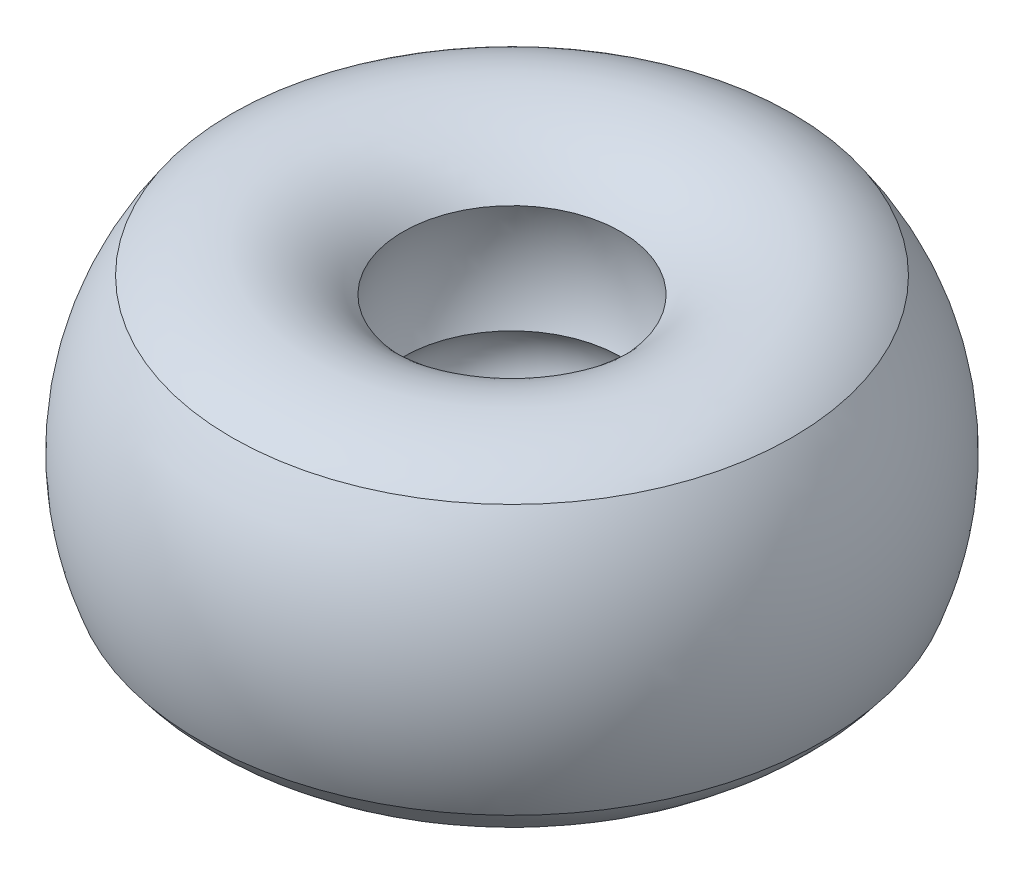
from build123d import *


with BuildPart() as part:
    # Area Lavoro → Volume area lavoro (revolve)
    with BuildSketch(Plane.XY, mode=Mode.PRIVATE) as volume_area_lavoro_sk:
        with BuildLine():
            ThreePointArc((-1024.186285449, 761.404392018), (-1123.216243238, 1270.869359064), (-1024.186285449, 1780.334326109))
            ThreePointArc((-1024.186285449, 1780.334326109), (-1798.351283, 2179.055500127), (-2634.372275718, 1935.377602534))
            ThreePointArc((-2634.372275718, 1935.377602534), (-3078.803311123, 814.573785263), (-2934.575550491, -382.471951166))
            ThreePointArc((-2934.575550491, -382.471951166), (-2138.014465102, -924.831089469), (-1182.047444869, -803.216724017))
            ThreePointArc((-1182.047444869, -803.216724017), (-1122.50300094, -318.266144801), (-870.859274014, 100.539346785))
            ThreePointArc((-870.859274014, 100.539346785), (-1094.640817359, 396.83907754), (-1024.186285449, 761.404392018))
        make_face()
    revolve(volume_area_lavoro_sk.sketch.rotate(Axis((0, 0, 0), (0, 1, 0)), 270), axis=Axis((0, 0, 0), (0, 1, 0)))


solid = part.part
